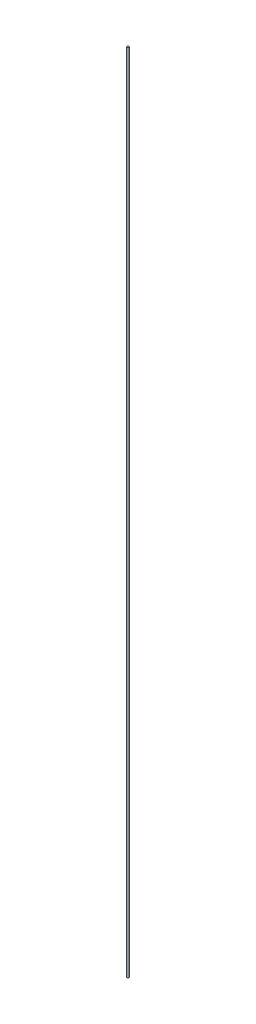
ISO-10303-21;
HEADER;
FILE_DESCRIPTION(('STEP AP214'),'2;1');
FILE_NAME('part.step','',(''),(''),'','','');
FILE_SCHEMA(('AUTOMOTIVE_DESIGN { 1 0 10303 214 1 1 1 1 }'));
ENDSEC;
DATA;
#1=APPLICATION_CONTEXT('core data for automotive mechanical design processes');
#2=APPLICATION_PROTOCOL_DEFINITION('international standard','automotive_design',2000,#1);
#3=PRODUCT_CONTEXT('',#1,'mechanical');
#4=PRODUCT('Part','Part','',(#3));
#5=PRODUCT_RELATED_PRODUCT_CATEGORY('part','',(#4));
#6=PRODUCT_DEFINITION_FORMATION('','',#4);
#7=PRODUCT_DEFINITION_CONTEXT('part definition',#1,'design');
#8=PRODUCT_DEFINITION('design','',#6,#7);
#9=PRODUCT_DEFINITION_SHAPE('','',#8);
#10=(LENGTH_UNIT() NAMED_UNIT(*) SI_UNIT(.MILLI.,.METRE.));
#11=(NAMED_UNIT(*) PLANE_ANGLE_UNIT() SI_UNIT($,.RADIAN.));
#12=(NAMED_UNIT(*) SI_UNIT($,.STERADIAN.) SOLID_ANGLE_UNIT());
#13=UNCERTAINTY_MEASURE_WITH_UNIT(LENGTH_MEASURE(1.E-05),#10,'distance_accuracy_value','');
#14=(GEOMETRIC_REPRESENTATION_CONTEXT(3) GLOBAL_UNCERTAINTY_ASSIGNED_CONTEXT((#13)) GLOBAL_UNIT_ASSIGNED_CONTEXT((#10,
#11,#12)) REPRESENTATION_CONTEXT('',''));
#15=CARTESIAN_POINT('',(0.,0.,0.));
#16=DIRECTION('',(0.,0.,1.));
#17=DIRECTION('',(1.,0.,0.));
#18=AXIS2_PLACEMENT_3D('',#15,#16,#17);
#19=CARTESIAN_POINT('',(0.,0.,0.));
#20=DIRECTION('',(0.,1.,0.));
#21=DIRECTION('',(0.,0.,1.));
#22=AXIS2_PLACEMENT_3D('',#19,#20,#21);
#23=PLANE('',#22);
#24=CARTESIAN_POINT('',(0.,0.,0.));
#25=DIRECTION('',(0.,1.,0.));
#26=DIRECTION('',(0.,0.,1.));
#27=AXIS2_PLACEMENT_3D('',#24,#25,#26);
#28=CIRCLE('',#27,2.);
#29=CARTESIAN_POINT('',(0.,0.,2.00000000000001));
#30=VERTEX_POINT('',#29);
#31=EDGE_CURVE('E43',#30,#30,#28,.T.);
#32=ORIENTED_EDGE('',*,*,#31,.F.);
#33=EDGE_LOOP('',(#32));
#34=FACE_BOUND('',#33,.T.);
#35=ADVANCED_FACE('F35',(#34),#23,.F.);
#36=CARTESIAN_POINT('',(0.,1500.,0.));
#37=DIRECTION('',(0.,1.,0.));
#38=DIRECTION('',(0.,0.,1.));
#39=AXIS2_PLACEMENT_3D('',#36,#37,#38);
#40=PLANE('',#39);
#41=CARTESIAN_POINT('',(0.,1500.,0.));
#42=DIRECTION('',(0.,1.,0.));
#43=DIRECTION('',(0.,0.,1.));
#44=AXIS2_PLACEMENT_3D('',#41,#42,#43);
#45=CIRCLE('',#44,2.);
#46=CARTESIAN_POINT('',(0.,1500.,2.));
#47=VERTEX_POINT('',#46);
#48=EDGE_CURVE('E11',#47,#47,#45,.T.);
#49=ORIENTED_EDGE('',*,*,#48,.T.);
#50=EDGE_LOOP('',(#49));
#51=FACE_BOUND('',#50,.T.);
#52=ADVANCED_FACE('F50',(#51),#40,.T.);
#53=CARTESIAN_POINT('',(0.,0.,0.));
#54=DIRECTION('',(0.,1.,0.));
#55=DIRECTION('',(0.,0.,1.));
#56=AXIS2_PLACEMENT_3D('',#53,#54,#55);
#57=CYLINDRICAL_SURFACE('',#56,2.);
#58=ORIENTED_EDGE('',*,*,#48,.F.);
#59=EDGE_LOOP('',(#58));
#60=FACE_BOUND('',#59,.T.);
#61=ORIENTED_EDGE('',*,*,#31,.T.);
#62=EDGE_LOOP('',(#61));
#63=FACE_BOUND('',#62,.T.);
#64=ADVANCED_FACE('F52',(#60,#63),#57,.T.);
#65=CLOSED_SHELL('',(#35,#52,#64));
#66=MANIFOLD_SOLID_BREP('B2',#65);
#67=ADVANCED_BREP_SHAPE_REPRESENTATION('',(#18,#66),#14);
#68=SHAPE_DEFINITION_REPRESENTATION(#9,#67);
ENDSEC;
END-ISO-10303-21;
